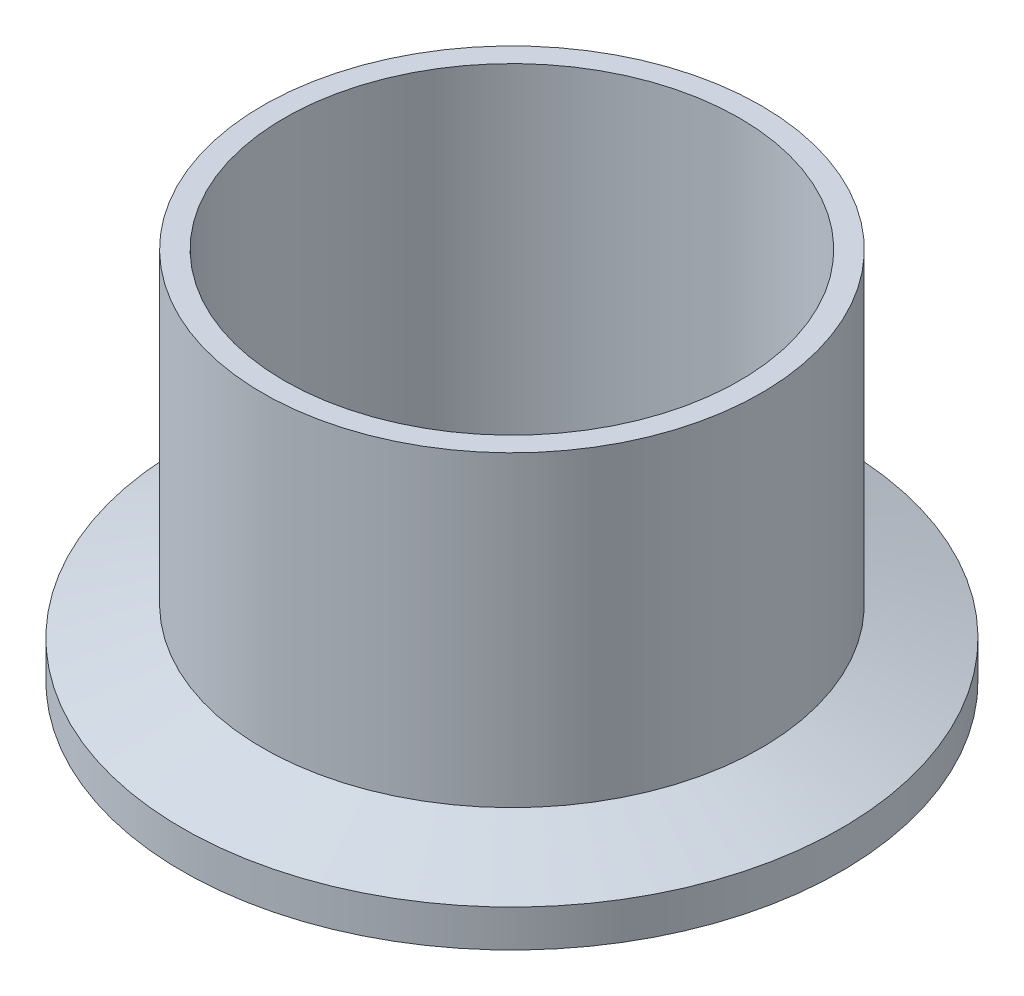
from build123d import *


with BuildPart() as part:
    # Sketch1 → Revolve2 (revolve)
    with BuildSketch(Plane.XY, mode=Mode.PRIVATE) as revolve2_sk:
        with BuildLine():
            Line((-17.399, 0), (-17.399, 28.575))
            Line((-17.399, 28.575), (-19.05, 28.575))
            Line((-19.05, 28.575), (-19.05, 5.082052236))
            Line((-19.05, 5.082052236), (-25.1968, 2.8448))
            Line((-25.1968, 2.8448), (-25.1968, 0))
            Line((-25.1968, 0), (-23.636608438, 0))
            ThreePointArc((-23.636608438, 0), (-23.204411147, 0.129217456), (-22.914066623, 0.474458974))
            ThreePointArc((-22.914066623, 0.474458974), (-21.8186, 1.1938), (-20.723133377, 0.474458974))
            ThreePointArc((-20.723133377, 0.474458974), (-20.432788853, 0.129217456), (-20.000591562, 0))
            Line((-20.000591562, 0), (-17.399, 0))
        make_face()
    revolve(revolve2_sk.sketch.rotate(Axis((0, 0, 0), (0, 1, 0)), 270), axis=Axis((0, 0, 0), (0, 1, 0)))


solid = part.part
